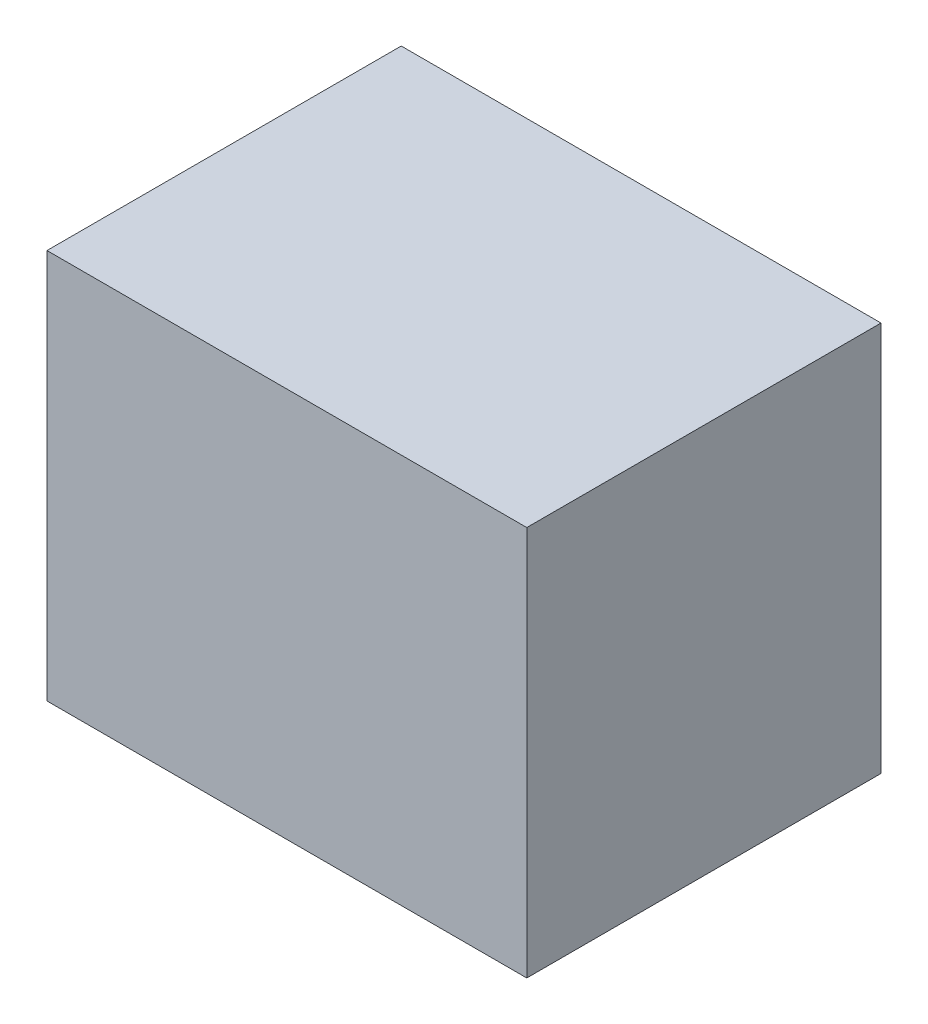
from build123d import *

# Parameters (mm, degrees)
SKETCH1_W               = 107
SKETCH1_H               = 87
BOSS_EXTRUDE1_DEPTH     = 79
CUT_EXTRUDE1_DEPTH      = 37.5
CUT_EXTRUDE1_DEPTH_BACK = 37.5
LPATTERN1_COUNT         = 2
LPATTERN1_PITCH         = 97.2
LPATTERN1_COUNT_DIR2    = 2
LPATTERN1_PITCH_DIR2    = 77.2


with BuildPart() as part:
    # Sketch1 → Boss-Extrude1 (new body)
    with BuildSketch(Plane.XY):
        Rectangle(SKETCH1_W, SKETCH1_H)
    extrude(amount=BOSS_EXTRUDE1_DEPTH)

    # Sketch2 → Cut-Extrude1 (cut, two sides: drawn at the far end of the back side and taken through both)
    with BuildSketch(Plane(origin=(0, 0, 0), x_dir=(1, 0, 0), z_dir=(0, 1, 0)).offset(-CUT_EXTRUDE1_DEPTH_BACK)):
        Polygon((-46.5, 0), (-36.381059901, -72), (36.381059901, -72), (46.5, 0), align=None)
    extrude(amount=CUT_EXTRUDE1_DEPTH + CUT_EXTRUDE1_DEPTH_BACK, mode=Mode.SUBTRACT)

    # Sketch3 → Cut-Revolve1 (revolve, cut)
    with BuildSketch(Plane(origin=(0, -38.5, 0), x_dir=(-1, 0, 0), z_dir=(0, -1, 0))):
        with BuildLine():
            Line((-48.5, 1.5), (-48.5, -1.5))
            ThreePointArc((-48.5, -1.5), (-50, 0), (-48.5, 1.5))
        make_face()
    cut_revolve1 = revolve(axis=Axis((48.5, -38.5, -1.5), (0, 0, 1)), mode=Mode.SUBTRACT)

    # LPattern1: Cut-Revolve1 2 × 2
    with Locations(*[(-i * LPATTERN1_PITCH, j * LPATTERN1_PITCH_DIR2, 0) for i in range(LPATTERN1_COUNT) for j in range(LPATTERN1_COUNT_DIR2) if (i, j) != (0, 0)]):
        add(cut_revolve1, mode=Mode.SUBTRACT)


solid = part.part
